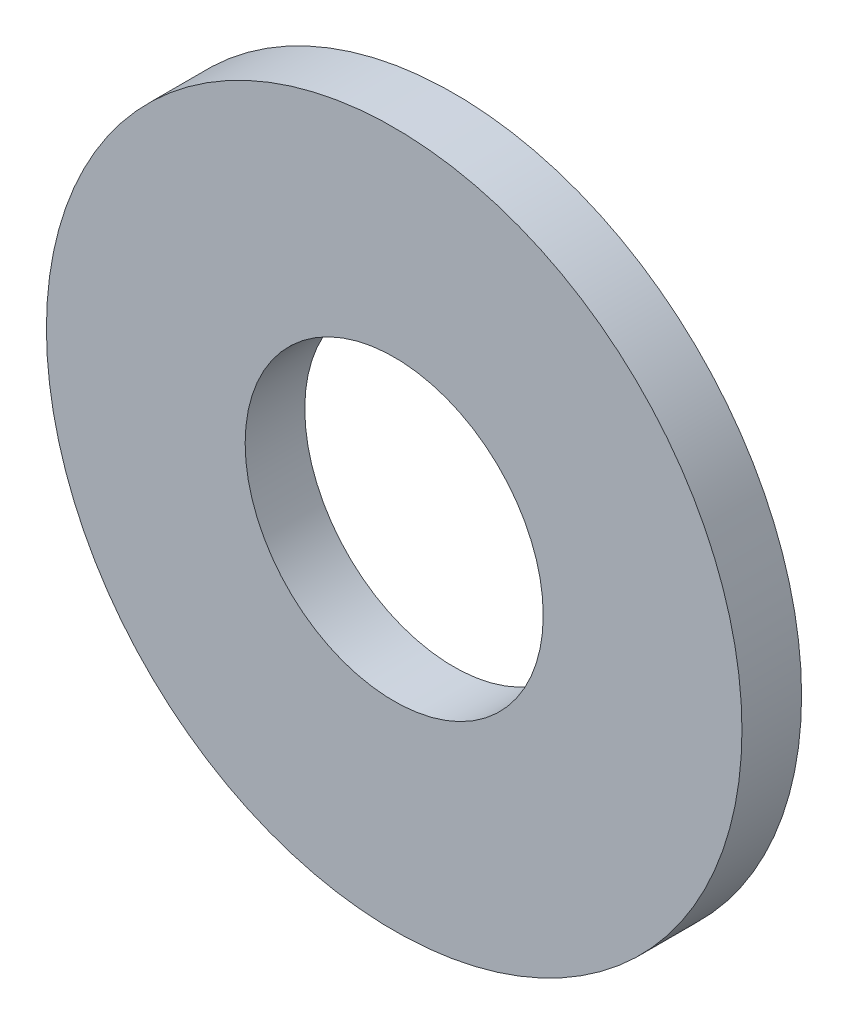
from build123d import *

# Parameters (mm, degrees)
SKETCH1_R           = 3.5
SKETCH1_R_2         = 1.5
BOSS_EXTRUDE1_DEPTH = 0.6


with BuildPart() as part:
    # Sketch1 → Boss-Extrude1 (new body)
    with BuildSketch(Plane.XY):
        Circle(SKETCH1_R)
        Circle(SKETCH1_R_2, mode=Mode.SUBTRACT)
    extrude(amount=BOSS_EXTRUDE1_DEPTH)


solid = part.part
